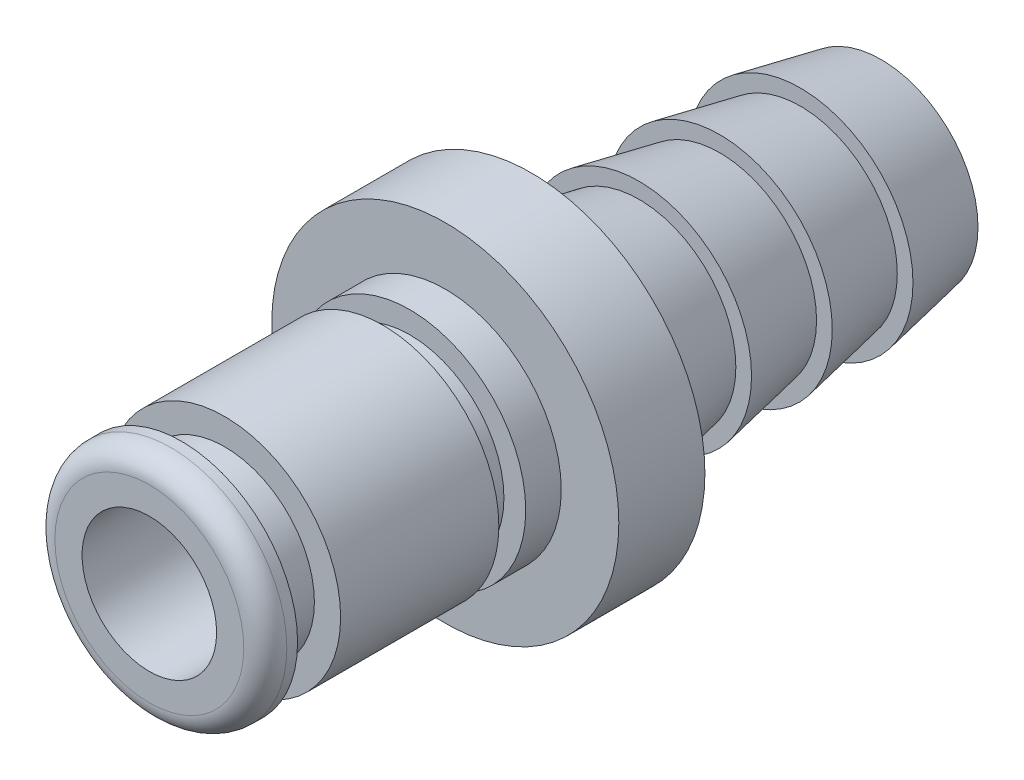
ISO-10303-21;
HEADER;
FILE_DESCRIPTION(('STEP AP214'),'2;1');
FILE_NAME('part.step','',(''),(''),'','','');
FILE_SCHEMA(('AUTOMOTIVE_DESIGN { 1 0 10303 214 1 1 1 1 }'));
ENDSEC;
DATA;
#1=APPLICATION_CONTEXT('core data for automotive mechanical design processes');
#2=APPLICATION_PROTOCOL_DEFINITION('international standard','automotive_design',2000,#1);
#3=PRODUCT_CONTEXT('',#1,'mechanical');
#4=PRODUCT('Part','Part','',(#3));
#5=PRODUCT_RELATED_PRODUCT_CATEGORY('part','',(#4));
#6=PRODUCT_DEFINITION_FORMATION('','',#4);
#7=PRODUCT_DEFINITION_CONTEXT('part definition',#1,'design');
#8=PRODUCT_DEFINITION('design','',#6,#7);
#9=PRODUCT_DEFINITION_SHAPE('','',#8);
#10=(LENGTH_UNIT() NAMED_UNIT(*) SI_UNIT(.MILLI.,.METRE.));
#11=(NAMED_UNIT(*) PLANE_ANGLE_UNIT() SI_UNIT($,.RADIAN.));
#12=(NAMED_UNIT(*) SI_UNIT($,.STERADIAN.) SOLID_ANGLE_UNIT());
#13=UNCERTAINTY_MEASURE_WITH_UNIT(LENGTH_MEASURE(1.E-05),#10,'distance_accuracy_value','');
#14=(GEOMETRIC_REPRESENTATION_CONTEXT(3) GLOBAL_UNCERTAINTY_ASSIGNED_CONTEXT((#13)) GLOBAL_UNIT_ASSIGNED_CONTEXT((#10,
#11,#12)) REPRESENTATION_CONTEXT('',''));
#15=CARTESIAN_POINT('',(0.,0.,0.));
#16=DIRECTION('',(0.,0.,1.));
#17=DIRECTION('',(1.,0.,0.));
#18=AXIS2_PLACEMENT_3D('',#15,#16,#17);
#19=CARTESIAN_POINT('',(0.,5.4737,-13.97));
#20=DIRECTION('',(0.,0.,-1.));
#21=DIRECTION('',(-1.,0.,0.));
#22=AXIS2_PLACEMENT_3D('',#19,#20,#21);
#23=PLANE('',#22);
#24=CARTESIAN_POINT('',(0.,0.,-13.97));
#25=DIRECTION('',(0.,0.,1.));
#26=DIRECTION('',(1.,0.,0.));
#27=AXIS2_PLACEMENT_3D('',#24,#25,#26);
#28=CIRCLE('',#27,8.1915);
#29=CARTESIAN_POINT('',(8.1915,0.,-13.97));
#30=VERTEX_POINT('',#29);
#31=EDGE_CURVE('E156',#30,#30,#28,.F.);
#32=ORIENTED_EDGE('',*,*,#31,.F.);
#33=EDGE_LOOP('',(#32));
#34=FACE_BOUND('',#33,.T.);
#35=CARTESIAN_POINT('',(0.,0.,-13.97));
#36=DIRECTION('',(0.,0.,1.));
#37=DIRECTION('',(1.,0.,0.));
#38=AXIS2_PLACEMENT_3D('',#35,#36,#37);
#39=CIRCLE('',#38,5.4737);
#40=CARTESIAN_POINT('',(5.4737,0.,-13.97));
#41=VERTEX_POINT('',#40);
#42=EDGE_CURVE('E153',#41,#41,#39,.T.);
#43=ORIENTED_EDGE('',*,*,#42,.F.);
#44=EDGE_LOOP('',(#43));
#45=FACE_BOUND('',#44,.T.);
#46=ADVANCED_FACE('F17',(#34,#45),#23,.F.);
#47=CARTESIAN_POINT('',(0.,0.,-18.034));
#48=DIRECTION('',(0.,0.,1.));
#49=DIRECTION('',(1.,0.,0.));
#50=AXIS2_PLACEMENT_3D('',#47,#48,#49);
#51=CYLINDRICAL_SURFACE('',#50,5.4737);
#52=CARTESIAN_POINT('',(0.,0.,-12.2936));
#53=DIRECTION('',(0.,0.,1.));
#54=DIRECTION('',(1.,0.,0.));
#55=AXIS2_PLACEMENT_3D('',#52,#53,#54);
#56=CIRCLE('',#55,5.4737);
#57=CARTESIAN_POINT('',(5.4737,0.,-12.2936));
#58=VERTEX_POINT('',#57);
#59=EDGE_CURVE('E159',#58,#58,#56,.F.);
#60=ORIENTED_EDGE('',*,*,#59,.T.);
#61=EDGE_LOOP('',(#60));
#62=FACE_BOUND('',#61,.T.);
#63=ORIENTED_EDGE('',*,*,#42,.T.);
#64=EDGE_LOOP('',(#63));
#65=FACE_BOUND('',#64,.T.);
#66=ADVANCED_FACE('F84',(#62,#65),#51,.T.);
#67=CARTESIAN_POINT('',(0.,0.,-18.034));
#68=DIRECTION('',(0.,0.,1.));
#69=DIRECTION('',(1.,0.,0.));
#70=AXIS2_PLACEMENT_3D('',#67,#68,#69);
#71=CYLINDRICAL_SURFACE('',#70,8.1915);
#72=ORIENTED_EDGE('',*,*,#31,.T.);
#73=EDGE_LOOP('',(#72));
#74=FACE_BOUND('',#73,.T.);
#75=CARTESIAN_POINT('',(0.,0.,-18.034));
#76=DIRECTION('',(0.,0.,1.));
#77=DIRECTION('',(1.,0.,0.));
#78=AXIS2_PLACEMENT_3D('',#75,#76,#77);
#79=CIRCLE('',#78,8.1915);
#80=CARTESIAN_POINT('',(8.1915,0.,-18.034));
#81=VERTEX_POINT('',#80);
#82=EDGE_CURVE('E161',#81,#81,#79,.T.);
#83=ORIENTED_EDGE('',*,*,#82,.T.);
#84=EDGE_LOOP('',(#83));
#85=FACE_BOUND('',#84,.T.);
#86=ADVANCED_FACE('F81',(#74,#85),#71,.T.);
#87=CARTESIAN_POINT('',(0.,4.445,-12.2936));
#88=DIRECTION('',(0.,0.,-1.));
#89=DIRECTION('',(-1.,0.,0.));
#90=AXIS2_PLACEMENT_3D('',#87,#88,#89);
#91=PLANE('',#90);
#92=ORIENTED_EDGE('',*,*,#59,.F.);
#93=EDGE_LOOP('',(#92));
#94=FACE_BOUND('',#93,.T.);
#95=CARTESIAN_POINT('',(0.,0.,-12.2936));
#96=DIRECTION('',(0.,0.,1.));
#97=DIRECTION('',(1.,0.,0.));
#98=AXIS2_PLACEMENT_3D('',#95,#96,#97);
#99=CIRCLE('',#98,4.445);
#100=CARTESIAN_POINT('',(4.445,0.,-12.2936));
#101=VERTEX_POINT('',#100);
#102=EDGE_CURVE('E53',#101,#101,#99,.T.);
#103=ORIENTED_EDGE('',*,*,#102,.F.);
#104=EDGE_LOOP('',(#103));
#105=FACE_BOUND('',#104,.T.);
#106=ADVANCED_FACE('F76',(#94,#105),#91,.F.);
#107=CARTESIAN_POINT('',(0.,8.1915,-18.034));
#108=DIRECTION('',(0.,0.,1.));
#109=DIRECTION('',(1.,0.,0.));
#110=AXIS2_PLACEMENT_3D('',#107,#108,#109);
#111=PLANE('',#110);
#112=ORIENTED_EDGE('',*,*,#82,.F.);
#113=EDGE_LOOP('',(#112));
#114=FACE_BOUND('',#113,.T.);
#115=CARTESIAN_POINT('',(0.,0.,-18.034));
#116=DIRECTION('',(0.,0.,-1.));
#117=DIRECTION('',(0.,-1.,0.));
#118=AXIS2_PLACEMENT_3D('',#115,#116,#117);
#119=CIRCLE('',#118,6.39697773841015);
#120=CARTESIAN_POINT('',(0.,6.39697773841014,-18.034));
#121=VERTEX_POINT('',#120);
#122=CARTESIAN_POINT('',(0.,-6.39697773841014,-18.034));
#123=VERTEX_POINT('',#122);
#124=EDGE_CURVE('E45',#121,#123,#119,.F.);
#125=ORIENTED_EDGE('',*,*,#124,.T.);
#126=CARTESIAN_POINT('',(0.,0.,-18.034));
#127=DIRECTION('',(0.,0.,-1.));
#128=DIRECTION('',(0.,1.,0.));
#129=AXIS2_PLACEMENT_3D('',#126,#127,#128);
#130=CIRCLE('',#129,6.39697773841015);
#131=EDGE_CURVE('E51',#123,#121,#130,.F.);
#132=ORIENTED_EDGE('',*,*,#131,.T.);
#133=EDGE_LOOP('',(#125,#132));
#134=FACE_BOUND('',#133,.T.);
#135=ADVANCED_FACE('F56',(#114,#134),#111,.F.);
#136=CARTESIAN_POINT('',(0.,0.,-18.034));
#137=DIRECTION('',(0.,0.,1.));
#138=DIRECTION('',(1.,0.,0.));
#139=AXIS2_PLACEMENT_3D('',#136,#137,#138);
#140=CYLINDRICAL_SURFACE('',#139,4.445);
#141=CARTESIAN_POINT('',(0.,0.,-11.0236));
#142=DIRECTION('',(0.,0.,1.));
#143=DIRECTION('',(1.,0.,0.));
#144=AXIS2_PLACEMENT_3D('',#141,#142,#143);
#145=CIRCLE('',#144,4.445);
#146=CARTESIAN_POINT('',(4.445,0.,-11.0236));
#147=VERTEX_POINT('',#146);
#148=EDGE_CURVE('E57',#147,#147,#145,.F.);
#149=ORIENTED_EDGE('',*,*,#148,.T.);
#150=EDGE_LOOP('',(#149));
#151=FACE_BOUND('',#150,.T.);
#152=ORIENTED_EDGE('',*,*,#102,.T.);
#153=EDGE_LOOP('',(#152));
#154=FACE_BOUND('',#153,.T.);
#155=ADVANCED_FACE('F75',(#151,#154),#140,.T.);
#156=CARTESIAN_POINT('',(0.,0.,-19.05));
#157=DIRECTION('',(0.,0.,1.));
#158=DIRECTION('',(0.,-1.,0.));
#159=AXIS2_PLACEMENT_3D('',#156,#157,#158);
#160=TOROIDAL_SURFACE('',#159,6.39697773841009,1.01599999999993);
#161=ORIENTED_EDGE('',*,*,#131,.F.);
#162=ORIENTED_EDGE('',*,*,#124,.F.);
#163=EDGE_LOOP('',(#161,#162));
#164=FACE_BOUND('',#163,.T.);
#165=CARTESIAN_POINT('',(0.,0.,-18.8561380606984));
#166=DIRECTION('',(0.,0.,1.));
#167=DIRECTION('',(0.,-1.,0.));
#168=AXIS2_PLACEMENT_3D('',#165,#166,#167);
#169=CIRCLE('',#168,5.3996445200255);
#170=CARTESIAN_POINT('',(0.,-5.3996445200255,-18.8561380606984));
#171=VERTEX_POINT('',#170);
#172=EDGE_CURVE('E168',#171,#171,#169,.F.);
#173=ORIENTED_EDGE('',*,*,#172,.F.);
#174=EDGE_LOOP('',(#173));
#175=FACE_BOUND('',#174,.T.);
#176=ADVANCED_FACE('F49',(#164,#175),#160,.F.);
#177=CARTESIAN_POINT('',(0.,5.4737,-11.0236));
#178=DIRECTION('',(0.,0.,1.));
#179=DIRECTION('',(1.,0.,0.));
#180=AXIS2_PLACEMENT_3D('',#177,#178,#179);
#181=PLANE('',#180);
#182=ORIENTED_EDGE('',*,*,#148,.F.);
#183=EDGE_LOOP('',(#182));
#184=FACE_BOUND('',#183,.T.);
#185=CARTESIAN_POINT('',(0.,0.,-11.0236));
#186=DIRECTION('',(0.,0.,1.));
#187=DIRECTION('',(1.,0.,0.));
#188=AXIS2_PLACEMENT_3D('',#185,#186,#187);
#189=CIRCLE('',#188,5.4737);
#190=CARTESIAN_POINT('',(5.4737,0.,-11.0236));
#191=VERTEX_POINT('',#190);
#192=EDGE_CURVE('E169',#191,#191,#189,.T.);
#193=ORIENTED_EDGE('',*,*,#192,.F.);
#194=EDGE_LOOP('',(#193));
#195=FACE_BOUND('',#194,.T.);
#196=ADVANCED_FACE('F218',(#184,#195),#181,.F.);
#197=CARTESIAN_POINT('',(0.,0.,-18.8561380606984));
#198=DIRECTION('',(0.,0.,1.));
#199=DIRECTION('',(1.,0.,0.));
#200=AXIS2_PLACEMENT_3D('',#197,#198,#199);
#201=CONICAL_SURFACE('',#200,5.3996445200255,0.191986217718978);
#202=ORIENTED_EDGE('',*,*,#172,.T.);
#203=EDGE_LOOP('',(#202));
#204=FACE_BOUND('',#203,.T.);
#205=CARTESIAN_POINT('',(0.,0.,-23.114000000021));
#206=DIRECTION('',(0.,0.,1.));
#207=DIRECTION('',(1.,0.,0.));
#208=AXIS2_PLACEMENT_3D('',#205,#206,#207);
#209=CIRCLE('',#208,4.57199999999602);
#210=CARTESIAN_POINT('',(4.57199999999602,0.,-23.114000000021));
#211=VERTEX_POINT('',#210);
#212=EDGE_CURVE('E172',#211,#211,#209,.T.);
#213=ORIENTED_EDGE('',*,*,#212,.T.);
#214=EDGE_LOOP('',(#213));
#215=FACE_BOUND('',#214,.T.);
#216=ADVANCED_FACE('F267',(#204,#215),#201,.T.);
#217=CARTESIAN_POINT('',(0.,0.,-18.034));
#218=DIRECTION('',(0.,0.,1.));
#219=DIRECTION('',(1.,0.,0.));
#220=AXIS2_PLACEMENT_3D('',#217,#218,#219);
#221=CYLINDRICAL_SURFACE('',#220,5.4737);
#222=CARTESIAN_POINT('',(0.,0.,-3.556));
#223=DIRECTION('',(0.,0.,1.));
#224=DIRECTION('',(1.,0.,0.));
#225=AXIS2_PLACEMENT_3D('',#222,#223,#224);
#226=CIRCLE('',#225,5.4737);
#227=CARTESIAN_POINT('',(5.4737,0.,-3.556));
#228=VERTEX_POINT('',#227);
#229=EDGE_CURVE('E175',#228,#228,#226,.F.);
#230=ORIENTED_EDGE('',*,*,#229,.T.);
#231=EDGE_LOOP('',(#230));
#232=FACE_BOUND('',#231,.T.);
#233=ORIENTED_EDGE('',*,*,#192,.T.);
#234=EDGE_LOOP('',(#233));
#235=FACE_BOUND('',#234,.T.);
#236=ADVANCED_FACE('F264',(#232,#235),#221,.T.);
#237=CARTESIAN_POINT('',(0.,4.572,-23.114));
#238=DIRECTION('',(0.,0.,-1.));
#239=DIRECTION('',(0.,1.,0.));
#240=AXIS2_PLACEMENT_3D('',#237,#238,#239);
#241=PLANE('',#240);
#242=CARTESIAN_POINT('',(0.,0.,-23.114000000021));
#243=DIRECTION('',(0.,0.,1.));
#244=DIRECTION('',(1.,0.,0.));
#245=AXIS2_PLACEMENT_3D('',#242,#243,#244);
#246=CIRCLE('',#245,5.31258897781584);
#247=CARTESIAN_POINT('',(5.31258897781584,0.,-23.114000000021));
#248=VERTEX_POINT('',#247);
#249=EDGE_CURVE('E178',#248,#248,#246,.F.);
#250=ORIENTED_EDGE('',*,*,#249,.F.);
#251=EDGE_LOOP('',(#250));
#252=FACE_BOUND('',#251,.T.);
#253=ORIENTED_EDGE('',*,*,#212,.F.);
#254=EDGE_LOOP('',(#253));
#255=FACE_BOUND('',#254,.T.);
#256=ADVANCED_FACE('F260',(#252,#255),#241,.F.);
#257=CARTESIAN_POINT('',(0.,4.23545,-3.556));
#258=DIRECTION('',(0.,0.,-1.));
#259=DIRECTION('',(-1.,0.,0.));
#260=AXIS2_PLACEMENT_3D('',#257,#258,#259);
#261=PLANE('',#260);
#262=ORIENTED_EDGE('',*,*,#229,.F.);
#263=EDGE_LOOP('',(#262));
#264=FACE_BOUND('',#263,.T.);
#265=CARTESIAN_POINT('',(0.,0.,-3.556));
#266=DIRECTION('',(0.,0.,1.));
#267=DIRECTION('',(1.,0.,0.));
#268=AXIS2_PLACEMENT_3D('',#265,#266,#267);
#269=CIRCLE('',#268,4.23545);
#270=CARTESIAN_POINT('',(4.23545,0.,-3.556));
#271=VERTEX_POINT('',#270);
#272=EDGE_CURVE('E181',#271,#271,#269,.T.);
#273=ORIENTED_EDGE('',*,*,#272,.F.);
#274=EDGE_LOOP('',(#273));
#275=FACE_BOUND('',#274,.T.);
#276=ADVANCED_FACE('F256',(#264,#275),#261,.F.);
#277=CARTESIAN_POINT('',(0.,0.,-23.114000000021));
#278=DIRECTION('',(0.,0.,1.));
#279=DIRECTION('',(1.,0.,0.));
#280=AXIS2_PLACEMENT_3D('',#277,#278,#279);
#281=CONICAL_SURFACE('',#280,5.31258897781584,0.191986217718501);
#282=ORIENTED_EDGE('',*,*,#249,.T.);
#283=EDGE_LOOP('',(#282));
#284=FACE_BOUND('',#283,.T.);
#285=CARTESIAN_POINT('',(0.,0.,-26.9240000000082));
#286=DIRECTION('',(0.,0.,1.));
#287=DIRECTION('',(1.,0.,0.));
#288=AXIS2_PLACEMENT_3D('',#285,#286,#287);
#289=CIRCLE('',#288,4.57200000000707);
#290=CARTESIAN_POINT('',(4.57200000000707,0.,-26.9240000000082));
#291=VERTEX_POINT('',#290);
#292=EDGE_CURVE('E184',#291,#291,#289,.T.);
#293=ORIENTED_EDGE('',*,*,#292,.T.);
#294=EDGE_LOOP('',(#293));
#295=FACE_BOUND('',#294,.T.);
#296=ADVANCED_FACE('F252',(#284,#295),#281,.T.);
#297=CARTESIAN_POINT('',(0.,0.,-18.034));
#298=DIRECTION('',(0.,0.,1.));
#299=DIRECTION('',(1.,0.,0.));
#300=AXIS2_PLACEMENT_3D('',#297,#298,#299);
#301=CYLINDRICAL_SURFACE('',#300,4.23545);
#302=CARTESIAN_POINT('',(0.,0.,-1.52400000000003));
#303=DIRECTION('',(0.,0.,1.));
#304=DIRECTION('',(1.,0.,0.));
#305=AXIS2_PLACEMENT_3D('',#302,#303,#304);
#306=CIRCLE('',#305,4.23545);
#307=CARTESIAN_POINT('',(4.23545,0.,-1.52400000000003));
#308=VERTEX_POINT('',#307);
#309=EDGE_CURVE('E187',#308,#308,#306,.F.);
#310=ORIENTED_EDGE('',*,*,#309,.T.);
#311=EDGE_LOOP('',(#310));
#312=FACE_BOUND('',#311,.T.);
#313=ORIENTED_EDGE('',*,*,#272,.T.);
#314=EDGE_LOOP('',(#313));
#315=FACE_BOUND('',#314,.T.);
#316=ADVANCED_FACE('F245',(#312,#315),#301,.T.);
#317=CARTESIAN_POINT('',(0.,4.572,-26.924));
#318=DIRECTION('',(0.,0.,-1.));
#319=DIRECTION('',(0.,1.,0.));
#320=AXIS2_PLACEMENT_3D('',#317,#318,#319);
#321=PLANE('',#320);
#322=CARTESIAN_POINT('',(0.,0.,-26.9240000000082));
#323=DIRECTION('',(0.,0.,1.));
#324=DIRECTION('',(1.,0.,0.));
#325=AXIS2_PLACEMENT_3D('',#322,#323,#324);
#326=CIRCLE('',#325,5.31258897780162);
#327=CARTESIAN_POINT('',(5.31258897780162,0.,-26.9240000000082));
#328=VERTEX_POINT('',#327);
#329=EDGE_CURVE('E190',#328,#328,#326,.F.);
#330=ORIENTED_EDGE('',*,*,#329,.F.);
#331=EDGE_LOOP('',(#330));
#332=FACE_BOUND('',#331,.T.);
#333=ORIENTED_EDGE('',*,*,#292,.F.);
#334=EDGE_LOOP('',(#333));
#335=FACE_BOUND('',#334,.T.);
#336=ADVANCED_FACE('F236',(#332,#335),#321,.F.);
#337=CARTESIAN_POINT('',(0.,5.4737,-1.52400000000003));
#338=DIRECTION('',(0.,0.,1.));
#339=DIRECTION('',(1.,0.,0.));
#340=AXIS2_PLACEMENT_3D('',#337,#338,#339);
#341=PLANE('',#340);
#342=ORIENTED_EDGE('',*,*,#309,.F.);
#343=EDGE_LOOP('',(#342));
#344=FACE_BOUND('',#343,.T.);
#345=CARTESIAN_POINT('',(0.,0.,-1.52400000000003));
#346=DIRECTION('',(0.,0.,1.));
#347=DIRECTION('',(1.,0.,0.));
#348=AXIS2_PLACEMENT_3D('',#345,#346,#347);
#349=CIRCLE('',#348,5.4737);
#350=CARTESIAN_POINT('',(5.4737,0.,-1.52400000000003));
#351=VERTEX_POINT('',#350);
#352=EDGE_CURVE('E193',#351,#351,#349,.T.);
#353=ORIENTED_EDGE('',*,*,#352,.F.);
#354=EDGE_LOOP('',(#353));
#355=FACE_BOUND('',#354,.T.);
#356=ADVANCED_FACE('F234',(#344,#355),#341,.F.);
#357=CARTESIAN_POINT('',(0.,0.,-26.9240000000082));
#358=DIRECTION('',(0.,0.,1.));
#359=DIRECTION('',(1.,0.,0.));
#360=AXIS2_PLACEMENT_3D('',#357,#358,#359);
#361=CONICAL_SURFACE('',#360,5.31258897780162,0.191986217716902);
#362=ORIENTED_EDGE('',*,*,#329,.T.);
#363=EDGE_LOOP('',(#362));
#364=FACE_BOUND('',#363,.T.);
#365=CARTESIAN_POINT('',(0.,0.,-30.7339999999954));
#366=DIRECTION('',(0.,0.,1.));
#367=DIRECTION('',(1.,0.,0.));
#368=AXIS2_PLACEMENT_3D('',#365,#366,#367);
#369=CIRCLE('',#368,4.57199999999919);
#370=CARTESIAN_POINT('',(4.57199999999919,0.,-30.7339999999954));
#371=VERTEX_POINT('',#370);
#372=EDGE_CURVE('E196',#371,#371,#369,.T.);
#373=ORIENTED_EDGE('',*,*,#372,.T.);
#374=EDGE_LOOP('',(#373));
#375=FACE_BOUND('',#374,.T.);
#376=ADVANCED_FACE('F231',(#364,#375),#361,.T.);
#377=CARTESIAN_POINT('',(0.,0.,-18.034));
#378=DIRECTION('',(0.,0.,1.));
#379=DIRECTION('',(1.,0.,0.));
#380=AXIS2_PLACEMENT_3D('',#377,#378,#379);
#381=CYLINDRICAL_SURFACE('',#380,5.4737);
#382=CARTESIAN_POINT('',(0.,0.,-1.01600000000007));
#383=DIRECTION('',(0.,0.,1.));
#384=DIRECTION('',(1.,0.,0.));
#385=AXIS2_PLACEMENT_3D('',#382,#383,#384);
#386=CIRCLE('',#385,5.4737);
#387=CARTESIAN_POINT('',(5.4737,0.,-1.01600000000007));
#388=VERTEX_POINT('',#387);
#389=EDGE_CURVE('E199',#388,#388,#386,.T.);
#390=ORIENTED_EDGE('',*,*,#389,.F.);
#391=EDGE_LOOP('',(#390));
#392=FACE_BOUND('',#391,.T.);
#393=ORIENTED_EDGE('',*,*,#352,.T.);
#394=EDGE_LOOP('',(#393));
#395=FACE_BOUND('',#394,.T.);
#396=ADVANCED_FACE('F228',(#392,#395),#381,.T.);
#397=CARTESIAN_POINT('',(0.,4.572,-30.734));
#398=DIRECTION('',(0.,0.,-1.));
#399=DIRECTION('',(0.,1.,0.));
#400=AXIS2_PLACEMENT_3D('',#397,#398,#399);
#401=PLANE('',#400);
#402=CARTESIAN_POINT('',(0.,0.,-30.7339999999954));
#403=DIRECTION('',(0.,0.,1.));
#404=DIRECTION('',(1.,0.,0.));
#405=AXIS2_PLACEMENT_3D('',#402,#403,#404);
#406=CIRCLE('',#405,5.31258897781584);
#407=CARTESIAN_POINT('',(5.31258897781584,0.,-30.7339999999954));
#408=VERTEX_POINT('',#407);
#409=EDGE_CURVE('E200',#408,#408,#406,.F.);
#410=ORIENTED_EDGE('',*,*,#409,.F.);
#411=EDGE_LOOP('',(#410));
#412=FACE_BOUND('',#411,.T.);
#413=ORIENTED_EDGE('',*,*,#372,.F.);
#414=EDGE_LOOP('',(#413));
#415=FACE_BOUND('',#414,.T.);
#416=ADVANCED_FACE('F136',(#412,#415),#401,.F.);
#417=CARTESIAN_POINT('',(0.,0.,-1.01600000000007));
#418=DIRECTION('',(0.,0.,1.));
#419=DIRECTION('',(1.,0.,0.));
#420=AXIS2_PLACEMENT_3D('',#417,#418,#419);
#421=TOROIDAL_SURFACE('',#420,4.45769999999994,1.01600000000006);
#422=CARTESIAN_POINT('',(0.,0.,0.));
#423=DIRECTION('',(0.,0.,-1.));
#424=DIRECTION('',(1.,0.,0.));
#425=AXIS2_PLACEMENT_3D('',#422,#423,#424);
#426=CIRCLE('',#425,4.45769999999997);
#427=CARTESIAN_POINT('',(4.45769999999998,0.,0.));
#428=VERTEX_POINT('',#427);
#429=CARTESIAN_POINT('',(-4.45769999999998,0.,0.));
#430=VERTEX_POINT('',#429);
#431=EDGE_CURVE('E152',#428,#430,#426,.T.);
#432=ORIENTED_EDGE('',*,*,#431,.T.);
#433=CARTESIAN_POINT('',(0.,0.,0.));
#434=DIRECTION('',(0.,0.,-1.));
#435=DIRECTION('',(-1.,0.,0.));
#436=AXIS2_PLACEMENT_3D('',#433,#434,#435);
#437=CIRCLE('',#436,4.45769999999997);
#438=EDGE_CURVE('E36',#430,#428,#437,.T.);
#439=ORIENTED_EDGE('',*,*,#438,.T.);
#440=EDGE_LOOP('',(#432,#439));
#441=FACE_BOUND('',#440,.T.);
#442=ORIENTED_EDGE('',*,*,#389,.T.);
#443=EDGE_LOOP('',(#442));
#444=FACE_BOUND('',#443,.T.);
#445=ADVANCED_FACE('F132',(#441,#444),#421,.T.);
#446=CARTESIAN_POINT('',(0.,0.,-30.7339999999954));
#447=DIRECTION('',(0.,0.,1.));
#448=DIRECTION('',(1.,0.,0.));
#449=AXIS2_PLACEMENT_3D('',#446,#447,#448);
#450=CONICAL_SURFACE('',#449,5.31258897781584,0.191986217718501);
#451=ORIENTED_EDGE('',*,*,#409,.T.);
#452=EDGE_LOOP('',(#451));
#453=FACE_BOUND('',#452,.T.);
#454=CARTESIAN_POINT('',(0.,0.,-34.5439999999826));
#455=DIRECTION('',(0.,0.,1.));
#456=DIRECTION('',(1.,0.,0.));
#457=AXIS2_PLACEMENT_3D('',#454,#455,#456);
#458=CIRCLE('',#457,4.57200000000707);
#459=CARTESIAN_POINT('',(4.57200000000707,0.,-34.5439999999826));
#460=VERTEX_POINT('',#459);
#461=EDGE_CURVE('E203',#460,#460,#458,.T.);
#462=ORIENTED_EDGE('',*,*,#461,.T.);
#463=EDGE_LOOP('',(#462));
#464=FACE_BOUND('',#463,.T.);
#465=ADVANCED_FACE('F112',(#453,#464),#450,.T.);
#466=CARTESIAN_POINT('',(0.,0.,0.));
#467=DIRECTION('',(0.,0.,-1.));
#468=DIRECTION('',(-1.,0.,0.));
#469=AXIS2_PLACEMENT_3D('',#466,#467,#468);
#470=PLANE('',#469);
#471=CARTESIAN_POINT('',(0.,0.,0.));
#472=DIRECTION('',(0.,0.,1.));
#473=DIRECTION('',(1.,0.,0.));
#474=AXIS2_PLACEMENT_3D('',#471,#472,#473);
#475=CIRCLE('',#474,3.175);
#476=CARTESIAN_POINT('',(3.175,0.,0.));
#477=VERTEX_POINT('',#476);
#478=EDGE_CURVE('E28',#477,#477,#475,.F.);
#479=ORIENTED_EDGE('',*,*,#478,.T.);
#480=EDGE_LOOP('',(#479));
#481=FACE_BOUND('',#480,.T.);
#482=ORIENTED_EDGE('',*,*,#431,.F.);
#483=ORIENTED_EDGE('',*,*,#438,.F.);
#484=EDGE_LOOP('',(#482,#483));
#485=FACE_BOUND('',#484,.T.);
#486=ADVANCED_FACE('F103',(#481,#485),#470,.F.);
#487=CARTESIAN_POINT('',(0.,4.572,-34.544));
#488=DIRECTION('',(0.,0.,1.));
#489=DIRECTION('',(0.,-1.,0.));
#490=AXIS2_PLACEMENT_3D('',#487,#488,#489);
#491=PLANE('',#490);
#492=CARTESIAN_POINT('',(0.,0.,-34.544));
#493=DIRECTION('',(0.,0.,1.));
#494=DIRECTION('',(1.,0.,0.));
#495=AXIS2_PLACEMENT_3D('',#492,#493,#494);
#496=CIRCLE('',#495,3.175);
#497=CARTESIAN_POINT('',(3.175,0.,-34.544));
#498=VERTEX_POINT('',#497);
#499=EDGE_CURVE('E11',#498,#498,#496,.T.);
#500=ORIENTED_EDGE('',*,*,#499,.T.);
#501=EDGE_LOOP('',(#500));
#502=FACE_BOUND('',#501,.T.);
#503=ORIENTED_EDGE('',*,*,#461,.F.);
#504=EDGE_LOOP('',(#503));
#505=FACE_BOUND('',#504,.T.);
#506=ADVANCED_FACE('F97',(#502,#505),#491,.F.);
#507=CARTESIAN_POINT('',(0.,0.,-34.544));
#508=DIRECTION('',(0.,0.,1.));
#509=DIRECTION('',(1.,0.,0.));
#510=AXIS2_PLACEMENT_3D('',#507,#508,#509);
#511=CYLINDRICAL_SURFACE('',#510,3.175);
#512=ORIENTED_EDGE('',*,*,#478,.F.);
#513=EDGE_LOOP('',(#512));
#514=FACE_BOUND('',#513,.T.);
#515=ORIENTED_EDGE('',*,*,#499,.F.);
#516=EDGE_LOOP('',(#515));
#517=FACE_BOUND('',#516,.T.);
#518=ADVANCED_FACE('F95',(#514,#517),#511,.F.);
#519=CLOSED_SHELL('',(#46,#66,#86,#106,#135,#155,#176,#196,#216,#236,#256,#276,#296,#316,#336,
#356,#376,#396,#416,#445,#465,#486,#506,#518));
#520=MANIFOLD_SOLID_BREP('B1',#519);
#521=ADVANCED_BREP_SHAPE_REPRESENTATION('',(#18,#520),#14);
#522=SHAPE_DEFINITION_REPRESENTATION(#9,#521);
ENDSEC;
END-ISO-10303-21;
